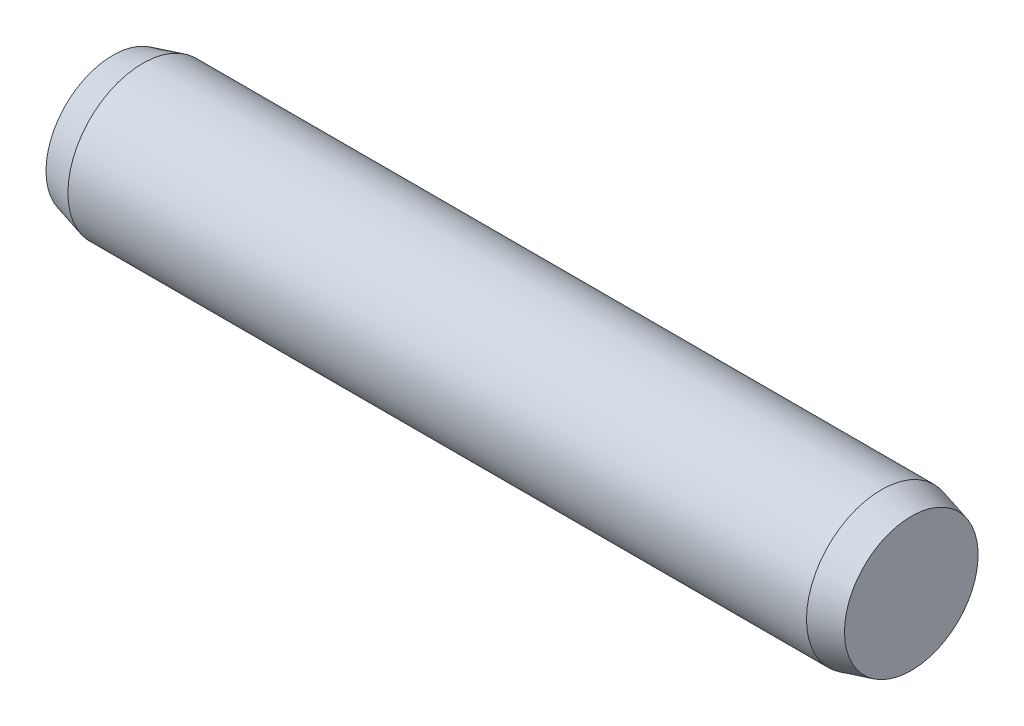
from build123d import *


with BuildPart() as part:
    # Sketch1 → Base-Revolve (revolve)
    with BuildSketch(Plane.XY, mode=Mode.PRIVATE) as base_revolve_sk:
        Polygon((0, 0), (32, 0), (32, 2.678460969), (30.8, 3), (1.2, 3), (0, 2.678460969), align=None)
    revolve(base_revolve_sk.sketch.rotate(Axis((-6.35, 0, 0), (1, 0, 0)), 90), axis=Axis((-6.35, 0, 0), (1, 0, 0)))


solid = part.part
